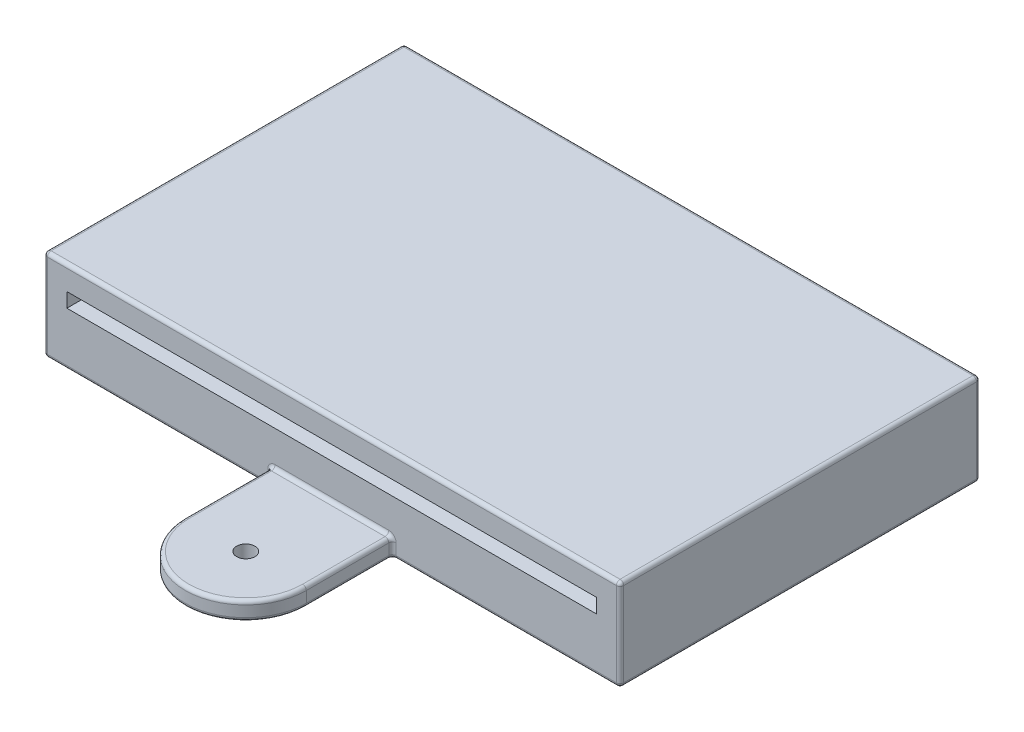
from build123d import *

# Parameters (mm, degrees)
SKETCH1_W          = 800
SKETCH1_H          = 500
EXTRUDE1_DEPTH     = 127
EXTRUDE2_DEPTH     = 25.4
SKETCH3_R          = 12.7
CUT_EXTRUDE1_DEPTH = 618.988687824
SKETCH4_W          = 735
SKETCH4_H          = 20
CUT_EXTRUDE2_DEPTH = 76.2
FILLET1_R          = 5.08


with BuildPart() as part:
    # Sketch1 → Extrude1 (new body)
    with BuildSketch(Plane(origin=(0, 0, 0), x_dir=(1, 0, 0), z_dir=(0, 1, 0))):
        Rectangle(SKETCH1_W, SKETCH1_H)
    extrude(amount=EXTRUDE1_DEPTH)

    # Sketch2 → Extrude2 (add)
    with BuildSketch(Plane.XZ):
        with BuildLine():
            Line((-83.996927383, 250), (-83.996927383, 369.634))
            ThreePointArc((-83.996927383, 369.634), (0, 453.630927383), (83.996927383, 369.634))
            Line((83.996927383, 369.634), (83.996927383, 250))
            Line((83.996927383, 250), (-83.996927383, 250))
        make_face()
    extrude(amount=-EXTRUDE2_DEPTH)

    # Sketch3 → Cut-Extrude1 (cut, through all)
    with BuildSketch(Plane.XZ):
        with Locations(Location((0, 369.634, 0), (0, 0, 270))):
            Circle(SKETCH3_R)
    extrude(amount=-CUT_EXTRUDE1_DEPTH, mode=Mode.SUBTRACT)

    # Sketch4 → Cut-Extrude2 (cut)
    with BuildSketch(Plane.XY.offset(250)):
        with Locations((-0.5, 84)):
            Rectangle(SKETCH4_W, SKETCH4_H)
    extrude(amount=-CUT_EXTRUDE2_DEPTH, mode=Mode.SUBTRACT)

    # Fillet1
    fillet1_edges = [part.edges().sort_by_distance(p)[0] for p in [
        (400, 127, 0),
        (0, 127, -250),
        (241.998463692, 0, 250),
        (0, 25.4, 250),
        (83.996927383, 12.7, 250),
        (-83.996927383, 25.4, 309.817),
        (-83.996927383, 12.7, 250),
        (0, 25.4, 453.630927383),
        (83.996927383, 25.4, 309.817),
        (83.996927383, 0, 309.817),
        (0, 0, 453.630927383),
        (-83.996927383, 0, 309.817),
        (0, 0, 382.334),
        (-400, 127, 0),
        (0, 0, -250),
        (400, 0, 0),
        (-241.998463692, 0, 250),
        (-400, 0, 0),
        (0, 127, 250),
        (-400, 63.5, -250),
        (400, 63.5, -250),
        (400, 63.5, 250),
        (-400, 63.5, 250),
    ]]
    fillet(fillet1_edges, radius=FILLET1_R)


solid = part.part
